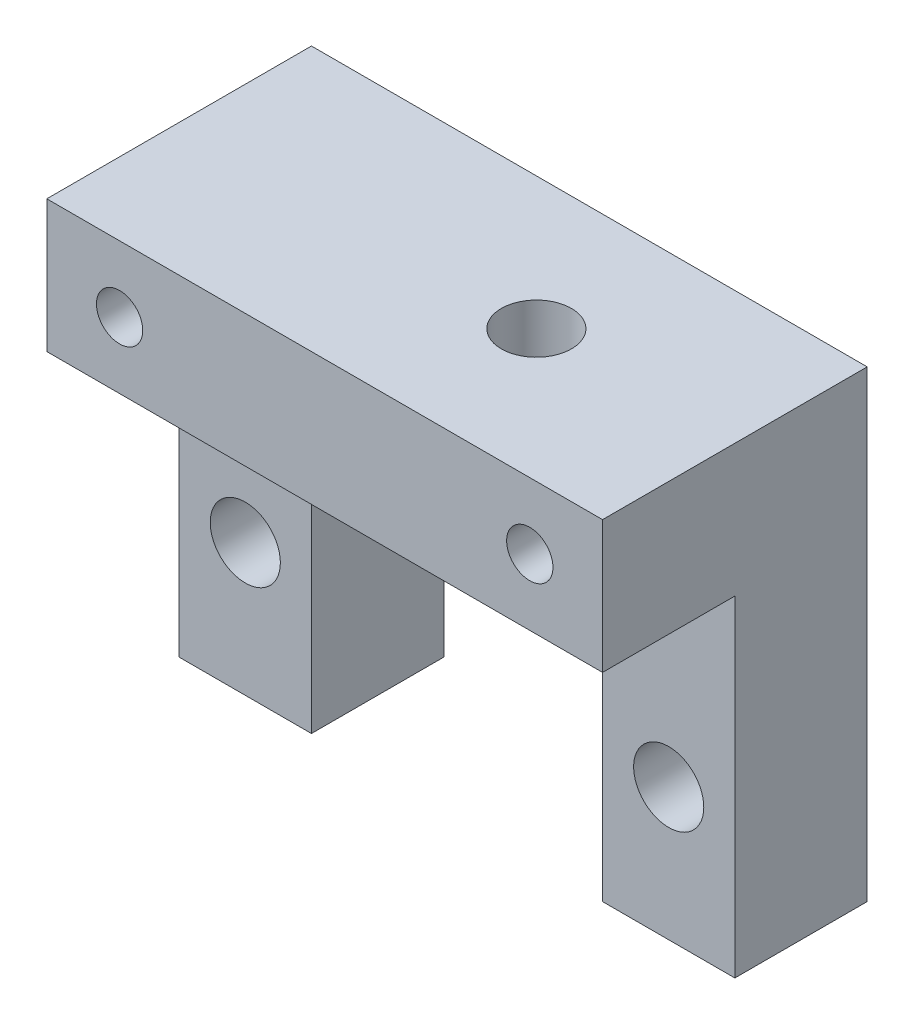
from build123d import *

# Parameters (mm, degrees)
SKIZZE1_W                       = 42
SKIZZE1_H                       = 20
AUFSATZ_LINEAR_AUSTRAGEN1_DEPTH = 10
SKIZZE2_R                       = 1.75
SCHNITT_LINEAR_AUSTRAGEN1_DEPTH = 20
SKIZZE3_R                       = 2.65
SCHNITT_LINEAR_AUSTRAGEN2_DEPTH = 10
SKIZZE4_W                       = 10
SKIZZE4_H                       = 10
AUFSATZ_LINEAR_AUSTRAGEN2_DEPTH = 25
SKIZZE5_R                       = 2.65
SCHNITT_LINEAR_AUSTRAGEN3_DEPTH = 10


with BuildPart() as part:
    # Skizze1 → Aufsatz-Linear austragen1 (new body)
    with BuildSketch(Plane(origin=(0, 0, 0), x_dir=(1, 0, 0), z_dir=(0, 1, 0))):
        with Locations((0, 0.550658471)):
            Rectangle(SKIZZE1_W, SKIZZE1_H)
    extrude(amount=AUFSATZ_LINEAR_AUSTRAGEN1_DEPTH)

    # Skizze2 → Schnitt-Linear austragen1 (cut)
    with BuildSketch(Plane.XY.offset(9.449341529)):
        with Locations((-15.5, 5)):
            Circle(SKIZZE2_R)
        with Locations((15.5, 5)):
            Circle(SKIZZE2_R)
    extrude(amount=-SCHNITT_LINEAR_AUSTRAGEN1_DEPTH, mode=Mode.SUBTRACT)

    # Skizze3 → Schnitt-Linear austragen2 (cut)
    with BuildSketch(Plane(origin=(0, 10, 0), x_dir=(1, 0, 0), z_dir=(0, 1, 0))):
        with Locations(Location((6, 0.550658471, 0), (0, 0, 270))):
            Circle(SKIZZE3_R)
    extrude(amount=-SCHNITT_LINEAR_AUSTRAGEN2_DEPTH, mode=Mode.SUBTRACT)

    # Skizze4 → Aufsatz-Linear austragen2 (add)
    with BuildSketch(Plane(origin=(0, 0, 0), x_dir=(-1, 0, 0), z_dir=(0, -1, 0))):
        with Locations((-16, 5.550658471)):
            Rectangle(SKIZZE4_W, SKIZZE4_H)
        with Locations((16, 5.550658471)):
            Rectangle(SKIZZE4_W, SKIZZE4_H)
    extrude(amount=AUFSATZ_LINEAR_AUSTRAGEN2_DEPTH)

    # Skizze5 → Schnitt-Linear austragen3 (cut)
    with BuildSketch(Plane.XY.offset(-0.550658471)):
        with Locations((16, -15)):
            Circle(SKIZZE5_R)
        with Locations((-16, -15)):
            Circle(SKIZZE5_R)
    extrude(amount=-SCHNITT_LINEAR_AUSTRAGEN3_DEPTH, mode=Mode.SUBTRACT)


solid = part.part
